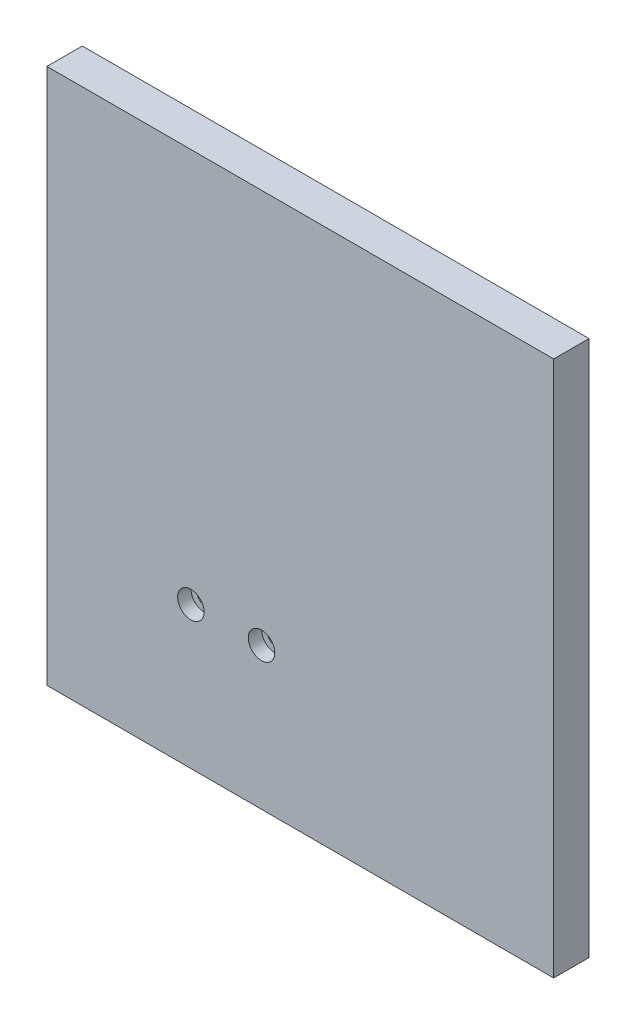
from build123d import *

# Parameters (mm, degrees)
SKETCH1_W                                       = 182.154670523
SKETCH1_H                                       = 192.717617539
EXTRUDE1_DEPTH                                  = 12.7
CBORE_FOR_10_SOCKET_HEAD_CAP_SCREW1_D           = 5.1054
CBORE_FOR_10_SOCKET_HEAD_CAP_SCREW1_CBORE_D     = 9.525
CBORE_FOR_10_SOCKET_HEAD_CAP_SCREW1_CBORE_DEPTH = 4.826


with BuildPart() as part:
    # Sketch1 → Extrude1 (new body)
    with BuildSketch(Plane.XY):
        with Locations((45.705085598, 50.397269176)):
            Rectangle(SKETCH1_W, SKETCH1_H)
    extrude(amount=EXTRUDE1_DEPTH)

    # CBORE for _10 Socket Head Cap Screw1 (through all)
    with Locations(Plane.XY.offset(12.7)):
        with Locations((31.75, 5.08), (6.35, 5.08)):
            CounterBoreHole(CBORE_FOR_10_SOCKET_HEAD_CAP_SCREW1_D / 2, CBORE_FOR_10_SOCKET_HEAD_CAP_SCREW1_CBORE_D / 2, CBORE_FOR_10_SOCKET_HEAD_CAP_SCREW1_CBORE_DEPTH)


solid = part.part
